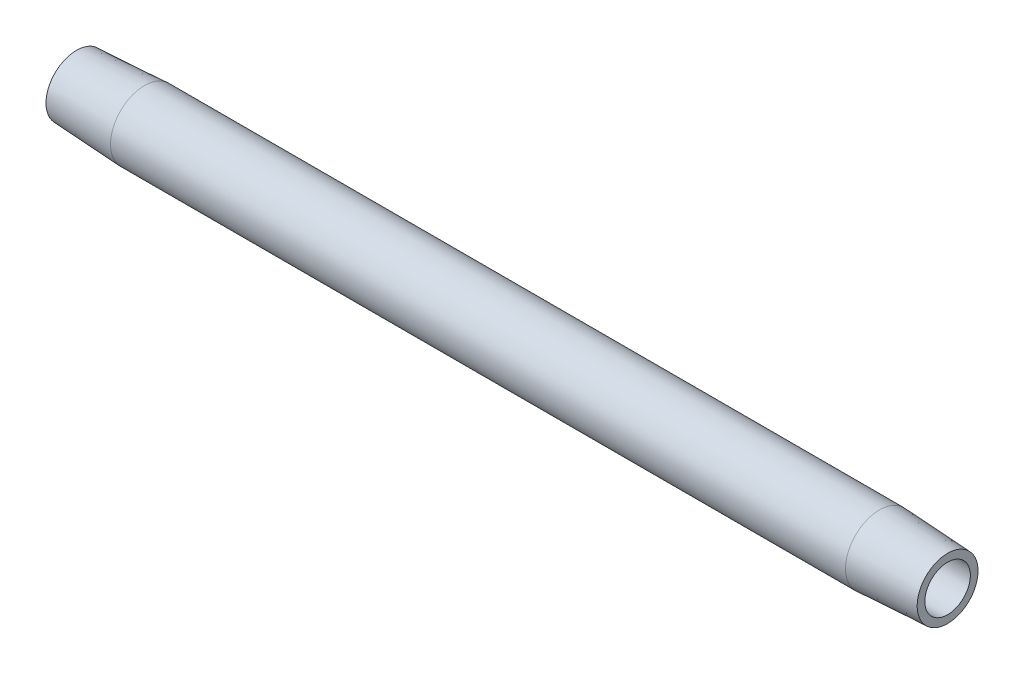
from build123d import *


with BuildPart() as part:
    # Sketch2 → Revolve1 (revolve)
    with BuildSketch(Plane.XY, mode=Mode.PRIVATE) as revolve1_sk:
        Polygon((7.9375, 3.96875), (0, 3.552763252), (0, 2.6543), (101.6, 2.6543), (101.6, 3.552763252), (93.6625, 3.96875), align=None)
    revolve(revolve1_sk.sketch.rotate(Axis((0.476141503, 0, 0), (1, 0, 0)), 90), axis=Axis((0.476141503, 0, 0), (1, 0, 0)))


solid = part.part
